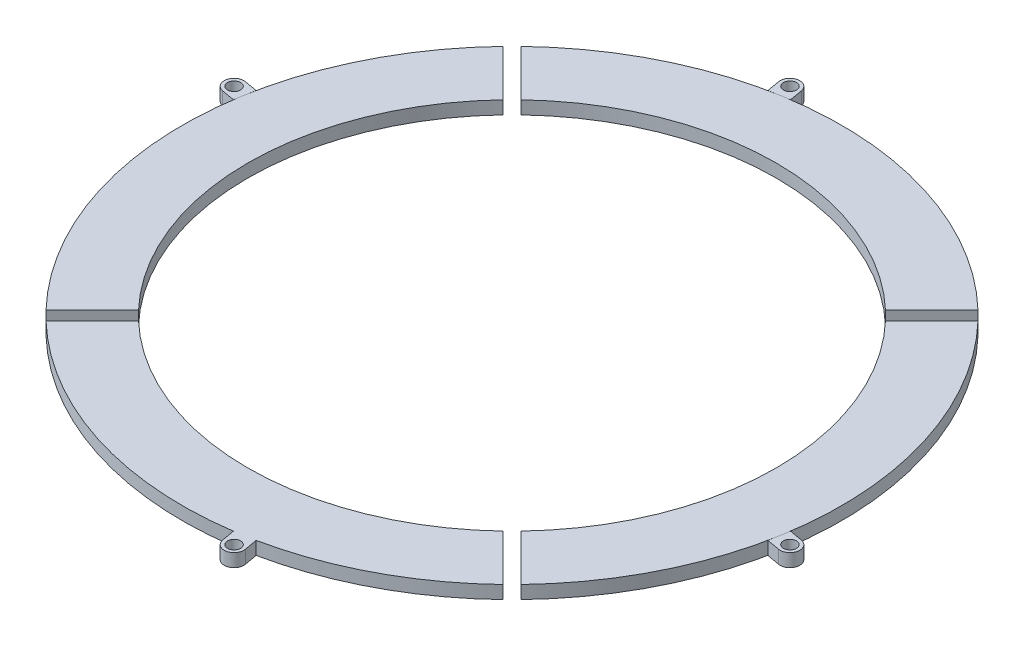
ISO-10303-21;
HEADER;
FILE_DESCRIPTION(('STEP AP214'),'2;1');
FILE_NAME('part.step','',(''),(''),'','','');
FILE_SCHEMA(('AUTOMOTIVE_DESIGN { 1 0 10303 214 1 1 1 1 }'));
ENDSEC;
DATA;
#1=APPLICATION_CONTEXT('core data for automotive mechanical design processes');
#2=APPLICATION_PROTOCOL_DEFINITION('international standard','automotive_design',2000,#1);
#3=PRODUCT_CONTEXT('',#1,'mechanical');
#4=PRODUCT('Part','Part','',(#3));
#5=PRODUCT_RELATED_PRODUCT_CATEGORY('part','',(#4));
#6=PRODUCT_DEFINITION_FORMATION('','',#4);
#7=PRODUCT_DEFINITION_CONTEXT('part definition',#1,'design');
#8=PRODUCT_DEFINITION('design','',#6,#7);
#9=PRODUCT_DEFINITION_SHAPE('','',#8);
#10=(LENGTH_UNIT() NAMED_UNIT(*) SI_UNIT(.MILLI.,.METRE.));
#11=(NAMED_UNIT(*) PLANE_ANGLE_UNIT() SI_UNIT($,.RADIAN.));
#12=(NAMED_UNIT(*) SI_UNIT($,.STERADIAN.) SOLID_ANGLE_UNIT());
#13=UNCERTAINTY_MEASURE_WITH_UNIT(LENGTH_MEASURE(1.E-05),#10,'distance_accuracy_value','');
#14=(GEOMETRIC_REPRESENTATION_CONTEXT(3) GLOBAL_UNCERTAINTY_ASSIGNED_CONTEXT((#13)) GLOBAL_UNIT_ASSIGNED_CONTEXT((#10,
#11,#12)) REPRESENTATION_CONTEXT('',''));
#15=CARTESIAN_POINT('',(0.,0.,0.));
#16=DIRECTION('',(0.,0.,1.));
#17=DIRECTION('',(1.,0.,0.));
#18=AXIS2_PLACEMENT_3D('',#15,#16,#17);
#19=CARTESIAN_POINT('',(-9.09916450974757,7.01559693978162,-51.6039262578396));
#20=DIRECTION('',(0.,-1.,0.));
#21=DIRECTION('',(0.,0.,-1.));
#22=AXIS2_PLACEMENT_3D('',#19,#20,#21);
#23=CYLINDRICAL_SURFACE('',#22,1.50000000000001);
#24=DIRECTION('',(0.,-1.,0.));
#25=VECTOR('',#24,1.);
#26=CARTESIAN_POINT('',(-10.5763761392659,7.01559693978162,-51.3434539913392));
#27=LINE('',#26,#25);
#28=CARTESIAN_POINT('',(-10.5763761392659,2.,-51.3434539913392));
#29=VERTEX_POINT('',#28);
#30=CARTESIAN_POINT('',(-10.5763761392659,0.,-51.3434539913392));
#31=VERTEX_POINT('',#30);
#32=EDGE_CURVE('E197',#29,#31,#27,.T.);
#33=ORIENTED_EDGE('',*,*,#32,.F.);
#34=CARTESIAN_POINT('',(-9.09916450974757,2.,-51.6039262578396));
#35=DIRECTION('',(0.,1.,0.));
#36=DIRECTION('',(0.,0.,1.));
#37=AXIS2_PLACEMENT_3D('',#34,#35,#36);
#38=CIRCLE('',#37,1.50000000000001);
#39=CARTESIAN_POINT('',(-7.62195288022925,2.,-51.86439852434));
#40=VERTEX_POINT('',#39);
#41=EDGE_CURVE('E187',#29,#40,#38,.F.);
#42=ORIENTED_EDGE('',*,*,#41,.T.);
#43=DIRECTION('',(0.,-1.,0.));
#44=VECTOR('',#43,1.);
#45=CARTESIAN_POINT('',(-7.62195288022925,7.01559693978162,-51.86439852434));
#46=LINE('',#45,#44);
#47=CARTESIAN_POINT('',(-7.62195288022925,0.,-51.86439852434));
#48=VERTEX_POINT('',#47);
#49=EDGE_CURVE('E152',#40,#48,#46,.T.);
#50=ORIENTED_EDGE('',*,*,#49,.T.);
#51=CARTESIAN_POINT('',(-9.09916450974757,0.,-51.6039262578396));
#52=DIRECTION('',(0.,-1.,0.));
#53=DIRECTION('',(0.,0.,-1.));
#54=AXIS2_PLACEMENT_3D('',#51,#52,#53);
#55=CIRCLE('',#54,1.50000000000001);
#56=EDGE_CURVE('E199',#31,#48,#55,.T.);
#57=ORIENTED_EDGE('',*,*,#56,.F.);
#58=EDGE_LOOP('',(#33,#42,#50,#57));
#59=FACE_BOUND('',#58,.T.);
#60=ADVANCED_FACE('F148',(#59),#23,.T.);
#61=CARTESIAN_POINT('',(-10.2252028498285,7.01559693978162,-49.3518512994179));
#62=DIRECTION('',(-0.984807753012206,0.,0.173648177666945));
#63=DIRECTION('',(0.173648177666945,0.,0.984807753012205));
#64=AXIS2_PLACEMENT_3D('',#61,#62,#63);
#65=PLANE('',#64);
#66=DIRECTION('',(0.,-1.,0.));
#67=VECTOR('',#66,1.);
#68=CARTESIAN_POINT('',(-10.2252028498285,7.01559693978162,-49.3518512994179));
#69=LINE('',#68,#67);
#70=CARTESIAN_POINT('',(-10.2252028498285,2.,-49.3518512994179));
#71=VERTEX_POINT('',#70);
#72=CARTESIAN_POINT('',(-10.2252028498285,0.,-49.3518512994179));
#73=VERTEX_POINT('',#72);
#74=EDGE_CURVE('E205',#71,#73,#69,.T.);
#75=ORIENTED_EDGE('',*,*,#74,.F.);
#76=DIRECTION('',(-0.173648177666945,0.,-0.984807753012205));
#77=VECTOR('',#76,1.);
#78=CARTESIAN_POINT('',(-10.2252028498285,2.,-49.3518512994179));
#79=LINE('',#78,#77);
#80=EDGE_CURVE('E191',#71,#29,#79,.T.);
#81=ORIENTED_EDGE('',*,*,#80,.T.);
#82=ORIENTED_EDGE('',*,*,#32,.T.);
#83=DIRECTION('',(-0.173648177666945,0.,-0.984807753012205));
#84=VECTOR('',#83,1.);
#85=CARTESIAN_POINT('',(-10.2252028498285,0.,-49.3518512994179));
#86=LINE('',#85,#84);
#87=EDGE_CURVE('E157',#73,#31,#86,.T.);
#88=ORIENTED_EDGE('',*,*,#87,.F.);
#89=EDGE_LOOP('',(#75,#81,#82,#88));
#90=FACE_BOUND('',#89,.T.);
#91=ADVANCED_FACE('F204',(#90),#65,.T.);
#92=CARTESIAN_POINT('',(-10.2252028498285,7.01559693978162,-49.3518512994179));
#93=DIRECTION('',(0.173648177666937,0.,0.984807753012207));
#94=DIRECTION('',(0.984807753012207,0.,-0.173648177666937));
#95=AXIS2_PLACEMENT_3D('',#92,#93,#94);
#96=PLANE('',#95);
#97=DIRECTION('',(0.,-1.,0.));
#98=VECTOR('',#97,1.);
#99=CARTESIAN_POINT('',(-7.2707795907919,7.01559693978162,-49.8727958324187));
#100=LINE('',#99,#98);
#101=CARTESIAN_POINT('',(-7.2707795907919,2.,-49.8727958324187));
#102=VERTEX_POINT('',#101);
#103=CARTESIAN_POINT('',(-7.2707795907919,0.,-49.8727958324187));
#104=VERTEX_POINT('',#103);
#105=EDGE_CURVE('E210',#102,#104,#100,.T.);
#106=ORIENTED_EDGE('',*,*,#105,.F.);
#107=DIRECTION('',(-0.984807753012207,0.,0.173648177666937));
#108=VECTOR('',#107,1.);
#109=CARTESIAN_POINT('',(-10.2252028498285,2.,-49.3518512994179));
#110=LINE('',#109,#108);
#111=EDGE_CURVE('E171',#102,#71,#110,.T.);
#112=ORIENTED_EDGE('',*,*,#111,.T.);
#113=ORIENTED_EDGE('',*,*,#74,.T.);
#114=DIRECTION('',(-0.984807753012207,0.,0.173648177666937));
#115=VECTOR('',#114,1.);
#116=CARTESIAN_POINT('',(-10.2252028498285,0.,-49.3518512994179));
#117=LINE('',#116,#115);
#118=EDGE_CURVE('E222',#104,#73,#117,.T.);
#119=ORIENTED_EDGE('',*,*,#118,.F.);
#120=EDGE_LOOP('',(#106,#112,#113,#119));
#121=FACE_BOUND('',#120,.T.);
#122=ADVANCED_FACE('F228',(#121),#96,.T.);
#123=CARTESIAN_POINT('',(-7.2707795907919,7.01559693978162,-49.8727958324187));
#124=DIRECTION('',(0.984807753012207,0.,-0.173648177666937));
#125=DIRECTION('',(-0.173648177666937,0.,-0.984807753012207));
#126=AXIS2_PLACEMENT_3D('',#123,#124,#125);
#127=PLANE('',#126);
#128=ORIENTED_EDGE('',*,*,#49,.F.);
#129=DIRECTION('',(0.173648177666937,0.,0.984807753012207));
#130=VECTOR('',#129,1.);
#131=CARTESIAN_POINT('',(-7.2707795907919,2.,-49.8727958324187));
#132=LINE('',#131,#130);
#133=EDGE_CURVE('E165',#40,#102,#132,.T.);
#134=ORIENTED_EDGE('',*,*,#133,.T.);
#135=ORIENTED_EDGE('',*,*,#105,.T.);
#136=DIRECTION('',(0.173648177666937,0.,0.984807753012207));
#137=VECTOR('',#136,1.);
#138=CARTESIAN_POINT('',(-7.2707795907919,0.,-49.8727958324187));
#139=LINE('',#138,#137);
#140=EDGE_CURVE('E219',#48,#104,#139,.T.);
#141=ORIENTED_EDGE('',*,*,#140,.F.);
#142=EDGE_LOOP('',(#128,#134,#135,#141));
#143=FACE_BOUND('',#142,.T.);
#144=ADVANCED_FACE('F230',(#143),#127,.T.);
#145=CARTESIAN_POINT('',(-9.09916450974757,7.01559693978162,-51.6039262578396));
#146=DIRECTION('',(0.,-1.,0.));
#147=DIRECTION('',(0.,0.,-1.));
#148=AXIS2_PLACEMENT_3D('',#145,#146,#147);
#149=CYLINDRICAL_SURFACE('',#148,0.999999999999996);
#150=CARTESIAN_POINT('',(-9.09916450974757,0.,-51.6039262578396));
#151=DIRECTION('',(0.,-1.,0.));
#152=DIRECTION('',(0.,0.,-1.));
#153=AXIS2_PLACEMENT_3D('',#150,#151,#152);
#154=CIRCLE('',#153,0.999999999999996);
#155=CARTESIAN_POINT('',(-9.09916450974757,0.,-52.6039262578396));
#156=VERTEX_POINT('',#155);
#157=EDGE_CURVE('E211',#156,#156,#154,.T.);
#158=ORIENTED_EDGE('',*,*,#157,.T.);
#159=EDGE_LOOP('',(#158));
#160=FACE_BOUND('',#159,.T.);
#161=CARTESIAN_POINT('',(-9.09916450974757,2.,-51.6039262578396));
#162=DIRECTION('',(0.,1.,0.));
#163=DIRECTION('',(0.,0.,1.));
#164=AXIS2_PLACEMENT_3D('',#161,#162,#163);
#165=CIRCLE('',#164,0.999999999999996);
#166=CARTESIAN_POINT('',(-9.09916450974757,2.,-50.6039262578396));
#167=VERTEX_POINT('',#166);
#168=EDGE_CURVE('E13',#167,#167,#165,.F.);
#169=ORIENTED_EDGE('',*,*,#168,.F.);
#170=EDGE_LOOP('',(#169));
#171=FACE_BOUND('',#170,.T.);
#172=ADVANCED_FACE('F236',(#160,#171),#149,.F.);
#173=CARTESIAN_POINT('',(-9.09916450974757,0.,-51.6039262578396));
#174=DIRECTION('',(0.,-1.,0.));
#175=DIRECTION('',(0.,0.,-1.));
#176=AXIS2_PLACEMENT_3D('',#173,#174,#175);
#177=PLANE('',#176);
#178=ORIENTED_EDGE('',*,*,#157,.F.);
#179=EDGE_LOOP('',(#178));
#180=FACE_BOUND('',#179,.T.);
#181=ORIENTED_EDGE('',*,*,#56,.T.);
#182=ORIENTED_EDGE('',*,*,#140,.T.);
#183=ORIENTED_EDGE('',*,*,#118,.T.);
#184=ORIENTED_EDGE('',*,*,#87,.T.);
#185=EDGE_LOOP('',(#181,#182,#183,#184));
#186=FACE_BOUND('',#185,.T.);
#187=ADVANCED_FACE('F226',(#180,#186),#177,.T.);
#188=CARTESIAN_POINT('',(0.,2.,0.));
#189=DIRECTION('',(0.,1.,0.));
#190=DIRECTION('',(0.,0.,1.));
#191=AXIS2_PLACEMENT_3D('',#188,#189,#190);
#192=PLANE('',#191);
#193=ORIENTED_EDGE('',*,*,#41,.F.);
#194=ORIENTED_EDGE('',*,*,#80,.F.);
#195=ORIENTED_EDGE('',*,*,#111,.F.);
#196=ORIENTED_EDGE('',*,*,#133,.F.);
#197=EDGE_LOOP('',(#193,#194,#195,#196));
#198=FACE_BOUND('',#197,.T.);
#199=ORIENTED_EDGE('',*,*,#168,.T.);
#200=EDGE_LOOP('',(#199));
#201=FACE_BOUND('',#200,.T.);
#202=ADVANCED_FACE('F150',(#198,#201),#192,.T.);
#203=CLOSED_SHELL('',(#60,#91,#122,#144,#172,#187,#202));
#204=MANIFOLD_SOLID_BREP('B2',#203);
#205=CARTESIAN_POINT('',(-51.6039262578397,7.01559693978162,-9.0991645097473));
#206=DIRECTION('',(0.,-1.,0.));
#207=DIRECTION('',(0.,0.,-1.));
#208=AXIS2_PLACEMENT_3D('',#205,#206,#207);
#209=CYLINDRICAL_SURFACE('',#208,1.5);
#210=DIRECTION('',(0.,-1.,0.));
#211=VECTOR('',#210,1.);
#212=CARTESIAN_POINT('',(-51.8643985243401,7.01559693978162,-7.62195288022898));
#213=LINE('',#212,#211);
#214=CARTESIAN_POINT('',(-51.8643985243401,2.,-7.62195288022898));
#215=VERTEX_POINT('',#214);
#216=CARTESIAN_POINT('',(-51.8643985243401,0.,-7.62195288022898));
#217=VERTEX_POINT('',#216);
#218=EDGE_CURVE('E352',#215,#217,#213,.T.);
#219=ORIENTED_EDGE('',*,*,#218,.F.);
#220=CARTESIAN_POINT('',(-51.6039262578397,2.,-9.0991645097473));
#221=DIRECTION('',(0.,1.,0.));
#222=DIRECTION('',(0.,0.,1.));
#223=AXIS2_PLACEMENT_3D('',#220,#221,#222);
#224=CIRCLE('',#223,1.5);
#225=CARTESIAN_POINT('',(-51.3434539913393,2.,-10.5763761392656));
#226=VERTEX_POINT('',#225);
#227=EDGE_CURVE('E342',#215,#226,#224,.F.);
#228=ORIENTED_EDGE('',*,*,#227,.T.);
#229=DIRECTION('',(0.,-1.,0.));
#230=VECTOR('',#229,1.);
#231=CARTESIAN_POINT('',(-51.3434539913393,7.01559693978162,-10.5763761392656));
#232=LINE('',#231,#230);
#233=CARTESIAN_POINT('',(-51.3434539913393,0.,-10.5763761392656));
#234=VERTEX_POINT('',#233);
#235=EDGE_CURVE('E307',#226,#234,#232,.T.);
#236=ORIENTED_EDGE('',*,*,#235,.T.);
#237=CARTESIAN_POINT('',(-51.6039262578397,0.,-9.0991645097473));
#238=DIRECTION('',(0.,-1.,0.));
#239=DIRECTION('',(0.,0.,1.));
#240=AXIS2_PLACEMENT_3D('',#237,#238,#239);
#241=CIRCLE('',#240,1.5);
#242=EDGE_CURVE('E354',#217,#234,#241,.T.);
#243=ORIENTED_EDGE('',*,*,#242,.F.);
#244=EDGE_LOOP('',(#219,#228,#236,#243));
#245=FACE_BOUND('',#244,.T.);
#246=ADVANCED_FACE('F303',(#245),#209,.T.);
#247=CARTESIAN_POINT('',(-49.8727958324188,7.01559693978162,-7.27077959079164));
#248=DIRECTION('',(-0.173648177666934,0.,0.984807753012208));
#249=DIRECTION('',(0.984807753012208,0.,0.173648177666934));
#250=AXIS2_PLACEMENT_3D('',#247,#248,#249);
#251=PLANE('',#250);
#252=DIRECTION('',(0.,-1.,0.));
#253=VECTOR('',#252,1.);
#254=CARTESIAN_POINT('',(-49.8727958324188,7.01559693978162,-7.27077959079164));
#255=LINE('',#254,#253);
#256=CARTESIAN_POINT('',(-49.8727958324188,2.,-7.27077959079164));
#257=VERTEX_POINT('',#256);
#258=CARTESIAN_POINT('',(-49.8727958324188,0.,-7.27077959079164));
#259=VERTEX_POINT('',#258);
#260=EDGE_CURVE('E360',#257,#259,#255,.T.);
#261=ORIENTED_EDGE('',*,*,#260,.F.);
#262=DIRECTION('',(-0.984807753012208,0.,-0.173648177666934));
#263=VECTOR('',#262,1.);
#264=CARTESIAN_POINT('',(-49.8727958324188,2.,-7.27077959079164));
#265=LINE('',#264,#263);
#266=EDGE_CURVE('E346',#257,#215,#265,.T.);
#267=ORIENTED_EDGE('',*,*,#266,.T.);
#268=ORIENTED_EDGE('',*,*,#218,.T.);
#269=DIRECTION('',(-0.984807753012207,0.,-0.173648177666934));
#270=VECTOR('',#269,1.);
#271=CARTESIAN_POINT('',(-49.8727958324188,0.,-7.27077959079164));
#272=LINE('',#271,#270);
#273=EDGE_CURVE('E312',#259,#217,#272,.T.);
#274=ORIENTED_EDGE('',*,*,#273,.F.);
#275=EDGE_LOOP('',(#261,#267,#268,#274));
#276=FACE_BOUND('',#275,.T.);
#277=ADVANCED_FACE('F359',(#276),#251,.T.);
#278=CARTESIAN_POINT('',(-49.351851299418,7.01559693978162,-10.2252028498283));
#279=DIRECTION('',(0.984807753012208,0.,0.173648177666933));
#280=DIRECTION('',(0.173648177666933,0.,-0.984807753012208));
#281=AXIS2_PLACEMENT_3D('',#278,#279,#280);
#282=PLANE('',#281);
#283=DIRECTION('',(0.,-1.,0.));
#284=VECTOR('',#283,1.);
#285=CARTESIAN_POINT('',(-49.351851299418,7.01559693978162,-10.2252028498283));
#286=LINE('',#285,#284);
#287=CARTESIAN_POINT('',(-49.351851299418,2.,-10.2252028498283));
#288=VERTEX_POINT('',#287);
#289=CARTESIAN_POINT('',(-49.351851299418,0.,-10.2252028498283));
#290=VERTEX_POINT('',#289);
#291=EDGE_CURVE('E365',#288,#290,#286,.T.);
#292=ORIENTED_EDGE('',*,*,#291,.F.);
#293=DIRECTION('',(-0.173648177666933,0.,0.984807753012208));
#294=VECTOR('',#293,1.);
#295=CARTESIAN_POINT('',(-49.351851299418,2.,-10.2252028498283));
#296=LINE('',#295,#294);
#297=EDGE_CURVE('E326',#288,#257,#296,.T.);
#298=ORIENTED_EDGE('',*,*,#297,.T.);
#299=ORIENTED_EDGE('',*,*,#260,.T.);
#300=DIRECTION('',(-0.173648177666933,0.,0.984807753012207));
#301=VECTOR('',#300,1.);
#302=CARTESIAN_POINT('',(-49.351851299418,0.,-10.2252028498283));
#303=LINE('',#302,#301);
#304=EDGE_CURVE('E377',#290,#259,#303,.T.);
#305=ORIENTED_EDGE('',*,*,#304,.F.);
#306=EDGE_LOOP('',(#292,#298,#299,#305));
#307=FACE_BOUND('',#306,.T.);
#308=ADVANCED_FACE('F383',(#307),#282,.T.);
#309=CARTESIAN_POINT('',(-49.351851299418,7.01559693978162,-10.2252028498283));
#310=DIRECTION('',(0.173648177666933,0.,-0.984807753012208));
#311=DIRECTION('',(-0.984807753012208,0.,-0.173648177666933));
#312=AXIS2_PLACEMENT_3D('',#309,#310,#311);
#313=PLANE('',#312);
#314=ORIENTED_EDGE('',*,*,#235,.F.);
#315=DIRECTION('',(0.984807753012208,0.,0.173648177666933));
#316=VECTOR('',#315,1.);
#317=CARTESIAN_POINT('',(-49.351851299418,2.,-10.2252028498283));
#318=LINE('',#317,#316);
#319=EDGE_CURVE('E320',#226,#288,#318,.T.);
#320=ORIENTED_EDGE('',*,*,#319,.T.);
#321=ORIENTED_EDGE('',*,*,#291,.T.);
#322=DIRECTION('',(0.984807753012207,0.,0.173648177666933));
#323=VECTOR('',#322,1.);
#324=CARTESIAN_POINT('',(-49.351851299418,0.,-10.2252028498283));
#325=LINE('',#324,#323);
#326=EDGE_CURVE('E374',#234,#290,#325,.T.);
#327=ORIENTED_EDGE('',*,*,#326,.F.);
#328=EDGE_LOOP('',(#314,#320,#321,#327));
#329=FACE_BOUND('',#328,.T.);
#330=ADVANCED_FACE('F385',(#329),#313,.T.);
#331=CARTESIAN_POINT('',(-51.6039262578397,7.01559693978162,-9.0991645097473));
#332=DIRECTION('',(0.,-1.,0.));
#333=DIRECTION('',(0.,0.,-1.));
#334=AXIS2_PLACEMENT_3D('',#331,#332,#333);
#335=CYLINDRICAL_SURFACE('',#334,0.999999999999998);
#336=CARTESIAN_POINT('',(-51.6039262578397,0.,-9.0991645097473));
#337=DIRECTION('',(0.,-1.,0.));
#338=DIRECTION('',(0.,0.,1.));
#339=AXIS2_PLACEMENT_3D('',#336,#337,#338);
#340=CIRCLE('',#339,0.999999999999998);
#341=CARTESIAN_POINT('',(-51.6039262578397,0.,-8.0991645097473));
#342=VERTEX_POINT('',#341);
#343=EDGE_CURVE('E366',#342,#342,#340,.T.);
#344=ORIENTED_EDGE('',*,*,#343,.T.);
#345=EDGE_LOOP('',(#344));
#346=FACE_BOUND('',#345,.T.);
#347=CARTESIAN_POINT('',(-51.6039262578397,2.,-9.0991645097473));
#348=DIRECTION('',(0.,1.,0.));
#349=DIRECTION('',(0.,0.,1.));
#350=AXIS2_PLACEMENT_3D('',#347,#348,#349);
#351=CIRCLE('',#350,0.999999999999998);
#352=CARTESIAN_POINT('',(-51.6039262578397,2.,-8.0991645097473));
#353=VERTEX_POINT('',#352);
#354=EDGE_CURVE('E146',#353,#353,#351,.F.);
#355=ORIENTED_EDGE('',*,*,#354,.F.);
#356=EDGE_LOOP('',(#355));
#357=FACE_BOUND('',#356,.T.);
#358=ADVANCED_FACE('F391',(#346,#357),#335,.F.);
#359=CARTESIAN_POINT('',(-51.6039262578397,0.,-9.0991645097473));
#360=DIRECTION('',(0.,1.,0.));
#361=DIRECTION('',(0.,0.,1.));
#362=AXIS2_PLACEMENT_3D('',#359,#360,#361);
#363=PLANE('',#362);
#364=ORIENTED_EDGE('',*,*,#343,.F.);
#365=EDGE_LOOP('',(#364));
#366=FACE_BOUND('',#365,.T.);
#367=ORIENTED_EDGE('',*,*,#242,.T.);
#368=ORIENTED_EDGE('',*,*,#326,.T.);
#369=ORIENTED_EDGE('',*,*,#304,.T.);
#370=ORIENTED_EDGE('',*,*,#273,.T.);
#371=EDGE_LOOP('',(#367,#368,#369,#370));
#372=FACE_BOUND('',#371,.T.);
#373=ADVANCED_FACE('F381',(#366,#372),#363,.F.);
#374=CARTESIAN_POINT('',(0.,2.,0.));
#375=DIRECTION('',(0.,1.,0.));
#376=DIRECTION('',(0.,0.,1.));
#377=AXIS2_PLACEMENT_3D('',#374,#375,#376);
#378=PLANE('',#377);
#379=ORIENTED_EDGE('',*,*,#227,.F.);
#380=ORIENTED_EDGE('',*,*,#266,.F.);
#381=ORIENTED_EDGE('',*,*,#297,.F.);
#382=ORIENTED_EDGE('',*,*,#319,.F.);
#383=EDGE_LOOP('',(#379,#380,#381,#382));
#384=FACE_BOUND('',#383,.T.);
#385=ORIENTED_EDGE('',*,*,#354,.T.);
#386=EDGE_LOOP('',(#385));
#387=FACE_BOUND('',#386,.T.);
#388=ADVANCED_FACE('F305',(#384,#387),#378,.T.);
#389=CLOSED_SHELL('',(#246,#277,#308,#330,#358,#373,#388));
#390=MANIFOLD_SOLID_BREP('B7',#389);
#391=CARTESIAN_POINT('',(51.6039262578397,7.01559693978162,9.0991645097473));
#392=DIRECTION('',(0.,-1.,0.));
#393=DIRECTION('',(0.,0.,-1.));
#394=AXIS2_PLACEMENT_3D('',#391,#392,#393);
#395=CYLINDRICAL_SURFACE('',#394,1.5);
#396=DIRECTION('',(0.,-1.,0.));
#397=VECTOR('',#396,1.);
#398=CARTESIAN_POINT('',(51.8643985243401,7.01559693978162,7.62195288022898));
#399=LINE('',#398,#397);
#400=CARTESIAN_POINT('',(51.8643985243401,2.,7.62195288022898));
#401=VERTEX_POINT('',#400);
#402=CARTESIAN_POINT('',(51.8643985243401,0.,7.62195288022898));
#403=VERTEX_POINT('',#402);
#404=EDGE_CURVE('E507',#401,#403,#399,.T.);
#405=ORIENTED_EDGE('',*,*,#404,.F.);
#406=CARTESIAN_POINT('',(51.6039262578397,2.,9.0991645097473));
#407=DIRECTION('',(0.,1.,0.));
#408=DIRECTION('',(0.,0.,1.));
#409=AXIS2_PLACEMENT_3D('',#406,#407,#408);
#410=CIRCLE('',#409,1.5);
#411=CARTESIAN_POINT('',(51.3434539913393,2.,10.5763761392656));
#412=VERTEX_POINT('',#411);
#413=EDGE_CURVE('E497',#401,#412,#410,.F.);
#414=ORIENTED_EDGE('',*,*,#413,.T.);
#415=DIRECTION('',(0.,-1.,0.));
#416=VECTOR('',#415,1.);
#417=CARTESIAN_POINT('',(51.3434539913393,7.01559693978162,10.5763761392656));
#418=LINE('',#417,#416);
#419=CARTESIAN_POINT('',(51.3434539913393,0.,10.5763761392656));
#420=VERTEX_POINT('',#419);
#421=EDGE_CURVE('E462',#412,#420,#418,.T.);
#422=ORIENTED_EDGE('',*,*,#421,.T.);
#423=CARTESIAN_POINT('',(51.6039262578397,0.,9.0991645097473));
#424=DIRECTION('',(0.,-1.,0.));
#425=DIRECTION('',(0.,0.,1.));
#426=AXIS2_PLACEMENT_3D('',#423,#424,#425);
#427=CIRCLE('',#426,1.5);
#428=EDGE_CURVE('E509',#403,#420,#427,.T.);
#429=ORIENTED_EDGE('',*,*,#428,.F.);
#430=EDGE_LOOP('',(#405,#414,#422,#429));
#431=FACE_BOUND('',#430,.T.);
#432=ADVANCED_FACE('F458',(#431),#395,.T.);
#433=CARTESIAN_POINT('',(49.8727958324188,7.01559693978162,7.27077959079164));
#434=DIRECTION('',(0.173648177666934,0.,-0.984807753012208));
#435=DIRECTION('',(-0.984807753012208,0.,-0.173648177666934));
#436=AXIS2_PLACEMENT_3D('',#433,#434,#435);
#437=PLANE('',#436);
#438=DIRECTION('',(0.,-1.,0.));
#439=VECTOR('',#438,1.);
#440=CARTESIAN_POINT('',(49.8727958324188,7.01559693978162,7.27077959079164));
#441=LINE('',#440,#439);
#442=CARTESIAN_POINT('',(49.8727958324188,2.,7.27077959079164));
#443=VERTEX_POINT('',#442);
#444=CARTESIAN_POINT('',(49.8727958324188,0.,7.27077959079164));
#445=VERTEX_POINT('',#444);
#446=EDGE_CURVE('E515',#443,#445,#441,.T.);
#447=ORIENTED_EDGE('',*,*,#446,.F.);
#448=DIRECTION('',(0.984807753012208,0.,0.173648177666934));
#449=VECTOR('',#448,1.);
#450=CARTESIAN_POINT('',(49.8727958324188,2.,7.27077959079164));
#451=LINE('',#450,#449);
#452=EDGE_CURVE('E501',#443,#401,#451,.T.);
#453=ORIENTED_EDGE('',*,*,#452,.T.);
#454=ORIENTED_EDGE('',*,*,#404,.T.);
#455=DIRECTION('',(0.984807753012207,0.,0.173648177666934));
#456=VECTOR('',#455,1.);
#457=CARTESIAN_POINT('',(49.8727958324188,0.,7.27077959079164));
#458=LINE('',#457,#456);
#459=EDGE_CURVE('E467',#445,#403,#458,.T.);
#460=ORIENTED_EDGE('',*,*,#459,.F.);
#461=EDGE_LOOP('',(#447,#453,#454,#460));
#462=FACE_BOUND('',#461,.T.);
#463=ADVANCED_FACE('F514',(#462),#437,.T.);
#464=CARTESIAN_POINT('',(49.351851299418,7.01559693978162,10.2252028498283));
#465=DIRECTION('',(-0.984807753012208,0.,-0.173648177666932));
#466=DIRECTION('',(-0.173648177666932,0.,0.984807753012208));
#467=AXIS2_PLACEMENT_3D('',#464,#465,#466);
#468=PLANE('',#467);
#469=DIRECTION('',(0.,-1.,0.));
#470=VECTOR('',#469,1.);
#471=CARTESIAN_POINT('',(49.351851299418,7.01559693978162,10.2252028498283));
#472=LINE('',#471,#470);
#473=CARTESIAN_POINT('',(49.351851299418,2.,10.2252028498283));
#474=VERTEX_POINT('',#473);
#475=CARTESIAN_POINT('',(49.351851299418,0.,10.2252028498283));
#476=VERTEX_POINT('',#475);
#477=EDGE_CURVE('E520',#474,#476,#472,.T.);
#478=ORIENTED_EDGE('',*,*,#477,.F.);
#479=DIRECTION('',(0.173648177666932,0.,-0.984807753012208));
#480=VECTOR('',#479,1.);
#481=CARTESIAN_POINT('',(49.351851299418,2.,10.2252028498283));
#482=LINE('',#481,#480);
#483=EDGE_CURVE('E481',#474,#443,#482,.T.);
#484=ORIENTED_EDGE('',*,*,#483,.T.);
#485=ORIENTED_EDGE('',*,*,#446,.T.);
#486=DIRECTION('',(0.173648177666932,0.,-0.984807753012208));
#487=VECTOR('',#486,1.);
#488=CARTESIAN_POINT('',(49.351851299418,0.,10.2252028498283));
#489=LINE('',#488,#487);
#490=EDGE_CURVE('E532',#476,#445,#489,.T.);
#491=ORIENTED_EDGE('',*,*,#490,.F.);
#492=EDGE_LOOP('',(#478,#484,#485,#491));
#493=FACE_BOUND('',#492,.T.);
#494=ADVANCED_FACE('F538',(#493),#468,.T.);
#495=CARTESIAN_POINT('',(49.351851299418,7.01559693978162,10.2252028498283));
#496=DIRECTION('',(-0.173648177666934,0.,0.984807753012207));
#497=DIRECTION('',(0.984807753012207,0.,0.173648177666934));
#498=AXIS2_PLACEMENT_3D('',#495,#496,#497);
#499=PLANE('',#498);
#500=ORIENTED_EDGE('',*,*,#421,.F.);
#501=DIRECTION('',(-0.984807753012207,0.,-0.173648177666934));
#502=VECTOR('',#501,1.);
#503=CARTESIAN_POINT('',(49.351851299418,2.,10.2252028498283));
#504=LINE('',#503,#502);
#505=EDGE_CURVE('E475',#412,#474,#504,.T.);
#506=ORIENTED_EDGE('',*,*,#505,.T.);
#507=ORIENTED_EDGE('',*,*,#477,.T.);
#508=DIRECTION('',(-0.984807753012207,0.,-0.173648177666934));
#509=VECTOR('',#508,1.);
#510=CARTESIAN_POINT('',(49.351851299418,0.,10.2252028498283));
#511=LINE('',#510,#509);
#512=EDGE_CURVE('E529',#420,#476,#511,.T.);
#513=ORIENTED_EDGE('',*,*,#512,.F.);
#514=EDGE_LOOP('',(#500,#506,#507,#513));
#515=FACE_BOUND('',#514,.T.);
#516=ADVANCED_FACE('F540',(#515),#499,.T.);
#517=CARTESIAN_POINT('',(51.6039262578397,7.01559693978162,9.0991645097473));
#518=DIRECTION('',(0.,-1.,0.));
#519=DIRECTION('',(0.,0.,-1.));
#520=AXIS2_PLACEMENT_3D('',#517,#518,#519);
#521=CYLINDRICAL_SURFACE('',#520,0.999999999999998);
#522=CARTESIAN_POINT('',(51.6039262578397,0.,9.0991645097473));
#523=DIRECTION('',(0.,-1.,0.));
#524=DIRECTION('',(0.,0.,1.));
#525=AXIS2_PLACEMENT_3D('',#522,#523,#524);
#526=CIRCLE('',#525,0.999999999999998);
#527=CARTESIAN_POINT('',(51.6039262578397,0.,10.0991645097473));
#528=VERTEX_POINT('',#527);
#529=EDGE_CURVE('E521',#528,#528,#526,.T.);
#530=ORIENTED_EDGE('',*,*,#529,.T.);
#531=EDGE_LOOP('',(#530));
#532=FACE_BOUND('',#531,.T.);
#533=CARTESIAN_POINT('',(51.6039262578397,2.,9.0991645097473));
#534=DIRECTION('',(0.,1.,0.));
#535=DIRECTION('',(0.,0.,1.));
#536=AXIS2_PLACEMENT_3D('',#533,#534,#535);
#537=CIRCLE('',#536,0.999999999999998);
#538=CARTESIAN_POINT('',(51.6039262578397,2.,10.0991645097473));
#539=VERTEX_POINT('',#538);
#540=EDGE_CURVE('E301',#539,#539,#537,.F.);
#541=ORIENTED_EDGE('',*,*,#540,.F.);
#542=EDGE_LOOP('',(#541));
#543=FACE_BOUND('',#542,.T.);
#544=ADVANCED_FACE('F546',(#532,#543),#521,.F.);
#545=CARTESIAN_POINT('',(51.6039262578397,0.,9.0991645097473));
#546=DIRECTION('',(0.,1.,0.));
#547=DIRECTION('',(0.,0.,1.));
#548=AXIS2_PLACEMENT_3D('',#545,#546,#547);
#549=PLANE('',#548);
#550=ORIENTED_EDGE('',*,*,#529,.F.);
#551=EDGE_LOOP('',(#550));
#552=FACE_BOUND('',#551,.T.);
#553=ORIENTED_EDGE('',*,*,#428,.T.);
#554=ORIENTED_EDGE('',*,*,#512,.T.);
#555=ORIENTED_EDGE('',*,*,#490,.T.);
#556=ORIENTED_EDGE('',*,*,#459,.T.);
#557=EDGE_LOOP('',(#553,#554,#555,#556));
#558=FACE_BOUND('',#557,.T.);
#559=ADVANCED_FACE('F536',(#552,#558),#549,.F.);
#560=CARTESIAN_POINT('',(0.,2.,0.));
#561=DIRECTION('',(0.,1.,0.));
#562=DIRECTION('',(0.,0.,1.));
#563=AXIS2_PLACEMENT_3D('',#560,#561,#562);
#564=PLANE('',#563);
#565=ORIENTED_EDGE('',*,*,#413,.F.);
#566=ORIENTED_EDGE('',*,*,#452,.F.);
#567=ORIENTED_EDGE('',*,*,#483,.F.);
#568=ORIENTED_EDGE('',*,*,#505,.F.);
#569=EDGE_LOOP('',(#565,#566,#567,#568));
#570=FACE_BOUND('',#569,.T.);
#571=ORIENTED_EDGE('',*,*,#540,.T.);
#572=EDGE_LOOP('',(#571));
#573=FACE_BOUND('',#572,.T.);
#574=ADVANCED_FACE('F460',(#570,#573),#564,.T.);
#575=CLOSED_SHELL('',(#432,#463,#494,#516,#544,#559,#574));
#576=MANIFOLD_SOLID_BREP('B140',#575);
#577=CARTESIAN_POINT('',(0.,2.,0.));
#578=DIRECTION('',(0.,-1.,0.));
#579=DIRECTION('',(0.,0.,-1.));
#580=AXIS2_PLACEMENT_3D('',#577,#578,#579);
#581=CYLINDRICAL_SURFACE('',#580,50.4);
#582=CARTESIAN_POINT('',(0.,2.,0.));
#583=DIRECTION('',(0.,1.,0.));
#584=DIRECTION('',(0.,0.,1.));
#585=AXIS2_PLACEMENT_3D('',#582,#583,#584);
#586=CIRCLE('',#585,50.4);
#587=CARTESIAN_POINT('',(10.2252028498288,2.,49.3518512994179));
#588=VERTEX_POINT('',#587);
#589=CARTESIAN_POINT('',(34.9240593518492,2.,36.3382729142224));
#590=VERTEX_POINT('',#589);
#591=EDGE_CURVE('E728',#588,#590,#586,.T.);
#592=ORIENTED_EDGE('',*,*,#591,.F.);
#593=DIRECTION('',(0.,-1.,0.));
#594=VECTOR('',#593,1.);
#595=CARTESIAN_POINT('',(10.2252028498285,7.01559693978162,49.3518512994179));
#596=LINE('',#595,#594);
#597=CARTESIAN_POINT('',(10.2252028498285,0.,49.3518512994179));
#598=VERTEX_POINT('',#597);
#599=EDGE_CURVE('E629',#588,#598,#596,.T.);
#600=ORIENTED_EDGE('',*,*,#599,.T.);
#601=CARTESIAN_POINT('',(0.,0.,0.));
#602=DIRECTION('',(0.,1.,0.));
#603=DIRECTION('',(0.,0.,1.));
#604=AXIS2_PLACEMENT_3D('',#601,#602,#603);
#605=CIRCLE('',#604,50.4);
#606=CARTESIAN_POINT('',(34.9240593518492,0.,36.3382729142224));
#607=VERTEX_POINT('',#606);
#608=EDGE_CURVE('E742',#598,#607,#605,.T.);
#609=ORIENTED_EDGE('',*,*,#608,.T.);
#610=DIRECTION('',(0.,-1.,0.));
#611=VECTOR('',#610,1.);
#612=CARTESIAN_POINT('',(34.9240593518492,2.,36.3382729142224));
#613=LINE('',#612,#611);
#614=EDGE_CURVE('E622',#590,#607,#613,.T.);
#615=ORIENTED_EDGE('',*,*,#614,.F.);
#616=EDGE_LOOP('',(#592,#600,#609,#615));
#617=FACE_BOUND('',#616,.T.);
#618=ADVANCED_FACE('F613',(#617),#581,.T.);
#619=CARTESIAN_POINT('',(0.707106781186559,2.,0.707106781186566));
#620=DIRECTION('',(-0.707106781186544,0.,-0.707106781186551));
#621=DIRECTION('',(-0.707106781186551,0.,0.707106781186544));
#622=AXIS2_PLACEMENT_3D('',#619,#620,#621);
#623=PLANE('',#622);
#624=DIRECTION('',(0.707106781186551,0.,-0.707106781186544));
#625=VECTOR('',#624,1.);
#626=CARTESIAN_POINT('',(0.707106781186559,0.,0.707106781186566));
#627=LINE('',#626,#625);
#628=CARTESIAN_POINT('',(-34.9240593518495,0.,36.3382729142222));
#629=VERTEX_POINT('',#628);
#630=CARTESIAN_POINT('',(-27.851254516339,0.,29.2654680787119));
#631=VERTEX_POINT('',#630);
#632=EDGE_CURVE('E739',#629,#631,#627,.T.);
#633=ORIENTED_EDGE('',*,*,#632,.F.);
#634=DIRECTION('',(0.,-1.,0.));
#635=VECTOR('',#634,1.);
#636=CARTESIAN_POINT('',(-34.9240593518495,2.,36.3382729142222));
#637=LINE('',#636,#635);
#638=CARTESIAN_POINT('',(-34.9240593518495,2.,36.3382729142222));
#639=VERTEX_POINT('',#638);
#640=EDGE_CURVE('E456',#639,#629,#637,.T.);
#641=ORIENTED_EDGE('',*,*,#640,.F.);
#642=DIRECTION('',(0.707106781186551,0.,-0.707106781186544));
#643=VECTOR('',#642,1.);
#644=CARTESIAN_POINT('',(0.707106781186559,2.,0.707106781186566));
#645=LINE('',#644,#643);
#646=CARTESIAN_POINT('',(-27.851254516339,2.,29.2654680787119));
#647=VERTEX_POINT('',#646);
#648=EDGE_CURVE('E725',#639,#647,#645,.T.);
#649=ORIENTED_EDGE('',*,*,#648,.T.);
#650=DIRECTION('',(0.,-1.,0.));
#651=VECTOR('',#650,1.);
#652=CARTESIAN_POINT('',(-27.851254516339,2.,29.2654680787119));
#653=LINE('',#652,#651);
#654=EDGE_CURVE('E638',#647,#631,#653,.T.);
#655=ORIENTED_EDGE('',*,*,#654,.T.);
#656=EDGE_LOOP('',(#633,#641,#649,#655));
#657=FACE_BOUND('',#656,.T.);
#658=ADVANCED_FACE('F615',(#657),#623,.T.);
#659=CARTESIAN_POINT('',(7.2707795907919,0.,49.8727958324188));
#660=VERTEX_POINT('',#659);
#661=EDGE_CURVE('E743',#629,#660,#605,.T.);
#662=ORIENTED_EDGE('',*,*,#661,.T.);
#663=DIRECTION('',(0.,-1.,0.));
#664=VECTOR('',#663,1.);
#665=CARTESIAN_POINT('',(7.2707795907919,7.01559693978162,49.8727958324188));
#666=LINE('',#665,#664);
#667=CARTESIAN_POINT('',(7.2707795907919,2.,49.8727958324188));
#668=VERTEX_POINT('',#667);
#669=EDGE_CURVE('E694',#668,#660,#666,.T.);
#670=ORIENTED_EDGE('',*,*,#669,.F.);
#671=EDGE_CURVE('E690',#639,#668,#586,.T.);
#672=ORIENTED_EDGE('',*,*,#671,.F.);
#673=ORIENTED_EDGE('',*,*,#640,.T.);
#674=EDGE_LOOP('',(#662,#670,#672,#673));
#675=FACE_BOUND('',#674,.T.);
#676=ADVANCED_FACE('F804',(#675),#581,.T.);
#677=CARTESIAN_POINT('',(-0.707106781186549,2.,0.707106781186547));
#678=DIRECTION('',(0.707106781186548,0.,-0.707106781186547));
#679=DIRECTION('',(-0.707106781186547,0.,-0.707106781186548));
#680=AXIS2_PLACEMENT_3D('',#677,#678,#679);
#681=PLANE('',#680);
#682=DIRECTION('',(0.707106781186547,0.,0.707106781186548));
#683=VECTOR('',#682,1.);
#684=CARTESIAN_POINT('',(-0.707106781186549,0.,0.707106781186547));
#685=LINE('',#684,#683);
#686=CARTESIAN_POINT('',(27.8512545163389,0.,29.265468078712));
#687=VERTEX_POINT('',#686);
#688=EDGE_CURVE('E747',#687,#607,#685,.T.);
#689=ORIENTED_EDGE('',*,*,#688,.F.);
#690=DIRECTION('',(0.,-1.,0.));
#691=VECTOR('',#690,1.);
#692=CARTESIAN_POINT('',(27.8512545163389,2.,29.265468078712));
#693=LINE('',#692,#691);
#694=CARTESIAN_POINT('',(27.8512545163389,2.,29.265468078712));
#695=VERTEX_POINT('',#694);
#696=EDGE_CURVE('E756',#695,#687,#693,.T.);
#697=ORIENTED_EDGE('',*,*,#696,.F.);
#698=DIRECTION('',(0.707106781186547,0.,0.707106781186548));
#699=VECTOR('',#698,1.);
#700=CARTESIAN_POINT('',(-0.707106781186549,2.,0.707106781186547));
#701=LINE('',#700,#699);
#702=EDGE_CURVE('E732',#695,#590,#701,.T.);
#703=ORIENTED_EDGE('',*,*,#702,.T.);
#704=ORIENTED_EDGE('',*,*,#614,.T.);
#705=EDGE_LOOP('',(#689,#697,#703,#704));
#706=FACE_BOUND('',#705,.T.);
#707=ADVANCED_FACE('F763',(#706),#681,.T.);
#708=CARTESIAN_POINT('',(0.,2.,0.));
#709=DIRECTION('',(0.,-1.,0.));
#710=DIRECTION('',(0.,0.,-1.));
#711=AXIS2_PLACEMENT_3D('',#708,#709,#710);
#712=CYLINDRICAL_SURFACE('',#711,40.4);
#713=CARTESIAN_POINT('',(0.,0.,0.));
#714=DIRECTION('',(0.,1.,0.));
#715=DIRECTION('',(0.,0.,1.));
#716=AXIS2_PLACEMENT_3D('',#713,#714,#715);
#717=CIRCLE('',#716,40.4);
#718=EDGE_CURVE('E729',#631,#687,#717,.T.);
#719=ORIENTED_EDGE('',*,*,#718,.F.);
#720=ORIENTED_EDGE('',*,*,#654,.F.);
#721=CARTESIAN_POINT('',(0.,2.,0.));
#722=DIRECTION('',(0.,1.,0.));
#723=DIRECTION('',(0.,0.,1.));
#724=AXIS2_PLACEMENT_3D('',#721,#722,#723);
#725=CIRCLE('',#724,40.4);
#726=EDGE_CURVE('E736',#647,#695,#725,.T.);
#727=ORIENTED_EDGE('',*,*,#726,.T.);
#728=ORIENTED_EDGE('',*,*,#696,.T.);
#729=EDGE_LOOP('',(#719,#720,#727,#728));
#730=FACE_BOUND('',#729,.T.);
#731=ADVANCED_FACE('F773',(#730),#712,.F.);
#732=CARTESIAN_POINT('',(0.,2.,0.));
#733=DIRECTION('',(0.,1.,0.));
#734=DIRECTION('',(0.,0.,1.));
#735=AXIS2_PLACEMENT_3D('',#732,#733,#734);
#736=PLANE('',#735);
#737=ORIENTED_EDGE('',*,*,#671,.T.);
#738=DIRECTION('',(-0.173648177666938,0.,-0.984807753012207));
#739=VECTOR('',#738,1.);
#740=CARTESIAN_POINT('',(7.2707795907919,2.,49.8727958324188));
#741=LINE('',#740,#739);
#742=CARTESIAN_POINT('',(7.62195288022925,2.,51.86439852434));
#743=VERTEX_POINT('',#742);
#744=EDGE_CURVE('E683',#743,#668,#741,.T.);
#745=ORIENTED_EDGE('',*,*,#744,.F.);
#746=CARTESIAN_POINT('',(9.09916450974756,2.,51.6039262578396));
#747=DIRECTION('',(0.,1.,0.));
#748=DIRECTION('',(0.,0.,1.));
#749=AXIS2_PLACEMENT_3D('',#746,#747,#748);
#750=CIRCLE('',#749,1.5);
#751=CARTESIAN_POINT('',(10.5763761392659,2.,51.3434539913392));
#752=VERTEX_POINT('',#751);
#753=EDGE_CURVE('E688',#752,#743,#750,.F.);
#754=ORIENTED_EDGE('',*,*,#753,.F.);
#755=DIRECTION('',(0.173648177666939,0.,0.984807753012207));
#756=VECTOR('',#755,1.);
#757=CARTESIAN_POINT('',(10.2252028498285,2.,49.3518512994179));
#758=LINE('',#757,#756);
#759=EDGE_CURVE('E718',#588,#752,#758,.T.);
#760=ORIENTED_EDGE('',*,*,#759,.F.);
#761=ORIENTED_EDGE('',*,*,#591,.T.);
#762=ORIENTED_EDGE('',*,*,#702,.F.);
#763=ORIENTED_EDGE('',*,*,#726,.F.);
#764=ORIENTED_EDGE('',*,*,#648,.F.);
#765=EDGE_LOOP('',(#737,#745,#754,#760,#761,#762,#763,#764));
#766=FACE_BOUND('',#765,.T.);
#767=CARTESIAN_POINT('',(9.09916450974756,2.,51.6039262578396));
#768=DIRECTION('',(0.,1.,0.));
#769=DIRECTION('',(0.,0.,1.));
#770=AXIS2_PLACEMENT_3D('',#767,#768,#769);
#771=CIRCLE('',#770,1.);
#772=CARTESIAN_POINT('',(9.09916450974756,2.,52.6039262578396));
#773=VERTEX_POINT('',#772);
#774=EDGE_CURVE('E716',#773,#773,#771,.F.);
#775=ORIENTED_EDGE('',*,*,#774,.T.);
#776=EDGE_LOOP('',(#775));
#777=FACE_BOUND('',#776,.T.);
#778=ADVANCED_FACE('F685',(#766,#777),#736,.T.);
#779=CARTESIAN_POINT('',(0.,0.,0.));
#780=DIRECTION('',(0.,1.,0.));
#781=DIRECTION('',(0.,0.,1.));
#782=AXIS2_PLACEMENT_3D('',#779,#780,#781);
#783=PLANE('',#782);
#784=ORIENTED_EDGE('',*,*,#608,.F.);
#785=DIRECTION('',(0.173648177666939,0.,0.984807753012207));
#786=VECTOR('',#785,1.);
#787=CARTESIAN_POINT('',(10.2252028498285,0.,49.3518512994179));
#788=LINE('',#787,#786);
#789=CARTESIAN_POINT('',(10.5763761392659,0.,51.3434539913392));
#790=VERTEX_POINT('',#789);
#791=EDGE_CURVE('E784',#598,#790,#788,.T.);
#792=ORIENTED_EDGE('',*,*,#791,.T.);
#793=CARTESIAN_POINT('',(9.09916450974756,0.,51.6039262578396));
#794=DIRECTION('',(0.,-1.,0.));
#795=DIRECTION('',(0.,0.,-1.));
#796=AXIS2_PLACEMENT_3D('',#793,#794,#795);
#797=CIRCLE('',#796,1.5);
#798=CARTESIAN_POINT('',(7.62195288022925,0.,51.86439852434));
#799=VERTEX_POINT('',#798);
#800=EDGE_CURVE('E781',#790,#799,#797,.T.);
#801=ORIENTED_EDGE('',*,*,#800,.T.);
#802=DIRECTION('',(-0.173648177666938,0.,-0.984807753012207));
#803=VECTOR('',#802,1.);
#804=CARTESIAN_POINT('',(7.2707795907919,0.,49.8727958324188));
#805=LINE('',#804,#803);
#806=EDGE_CURVE('E700',#799,#660,#805,.T.);
#807=ORIENTED_EDGE('',*,*,#806,.T.);
#808=ORIENTED_EDGE('',*,*,#661,.F.);
#809=ORIENTED_EDGE('',*,*,#632,.T.);
#810=ORIENTED_EDGE('',*,*,#718,.T.);
#811=ORIENTED_EDGE('',*,*,#688,.T.);
#812=EDGE_LOOP('',(#784,#792,#801,#807,#808,#809,#810,#811));
#813=FACE_BOUND('',#812,.T.);
#814=CARTESIAN_POINT('',(9.09916450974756,0.,51.6039262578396));
#815=DIRECTION('',(0.,-1.,0.));
#816=DIRECTION('',(0.,0.,-1.));
#817=AXIS2_PLACEMENT_3D('',#814,#815,#816);
#818=CIRCLE('',#817,1.);
#819=CARTESIAN_POINT('',(9.09916450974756,0.,50.6039262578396));
#820=VERTEX_POINT('',#819);
#821=EDGE_CURVE('E705',#820,#820,#818,.T.);
#822=ORIENTED_EDGE('',*,*,#821,.F.);
#823=EDGE_LOOP('',(#822));
#824=FACE_BOUND('',#823,.T.);
#825=ADVANCED_FACE('F769',(#813,#824),#783,.F.);
#826=CARTESIAN_POINT('',(10.2252028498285,7.01559693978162,49.3518512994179));
#827=DIRECTION('',(0.984807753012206,0.,-0.173648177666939));
#828=DIRECTION('',(-0.173648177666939,0.,-0.984807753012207));
#829=AXIS2_PLACEMENT_3D('',#826,#827,#828);
#830=PLANE('',#829);
#831=ORIENTED_EDGE('',*,*,#599,.F.);
#832=ORIENTED_EDGE('',*,*,#759,.T.);
#833=DIRECTION('',(0.,-1.,0.));
#834=VECTOR('',#833,1.);
#835=CARTESIAN_POINT('',(10.5763761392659,7.01559693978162,51.3434539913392));
#836=LINE('',#835,#834);
#837=EDGE_CURVE('E709',#752,#790,#836,.T.);
#838=ORIENTED_EDGE('',*,*,#837,.T.);
#839=ORIENTED_EDGE('',*,*,#791,.F.);
#840=EDGE_LOOP('',(#831,#832,#838,#839));
#841=FACE_BOUND('',#840,.T.);
#842=ADVANCED_FACE('F794',(#841),#830,.T.);
#843=CARTESIAN_POINT('',(7.2707795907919,7.01559693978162,49.8727958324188));
#844=DIRECTION('',(-0.984807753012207,0.,0.173648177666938));
#845=DIRECTION('',(0.173648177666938,0.,0.984807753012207));
#846=AXIS2_PLACEMENT_3D('',#843,#844,#845);
#847=PLANE('',#846);
#848=DIRECTION('',(0.,-1.,0.));
#849=VECTOR('',#848,1.);
#850=CARTESIAN_POINT('',(7.62195288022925,7.01559693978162,51.86439852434));
#851=LINE('',#850,#849);
#852=EDGE_CURVE('E697',#743,#799,#851,.T.);
#853=ORIENTED_EDGE('',*,*,#852,.F.);
#854=ORIENTED_EDGE('',*,*,#744,.T.);
#855=ORIENTED_EDGE('',*,*,#669,.T.);
#856=ORIENTED_EDGE('',*,*,#806,.F.);
#857=EDGE_LOOP('',(#853,#854,#855,#856));
#858=FACE_BOUND('',#857,.T.);
#859=ADVANCED_FACE('F698',(#858),#847,.T.);
#860=CARTESIAN_POINT('',(9.09916450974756,7.01559693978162,51.6039262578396));
#861=DIRECTION('',(0.,-1.,0.));
#862=DIRECTION('',(0.,0.,-1.));
#863=AXIS2_PLACEMENT_3D('',#860,#861,#862);
#864=CYLINDRICAL_SURFACE('',#863,1.5);
#865=ORIENTED_EDGE('',*,*,#837,.F.);
#866=ORIENTED_EDGE('',*,*,#753,.T.);
#867=ORIENTED_EDGE('',*,*,#852,.T.);
#868=ORIENTED_EDGE('',*,*,#800,.F.);
#869=EDGE_LOOP('',(#865,#866,#867,#868));
#870=FACE_BOUND('',#869,.T.);
#871=ADVANCED_FACE('F708',(#870),#864,.T.);
#872=CARTESIAN_POINT('',(9.09916450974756,7.01559693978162,51.6039262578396));
#873=DIRECTION('',(0.,-1.,0.));
#874=DIRECTION('',(0.,0.,-1.));
#875=AXIS2_PLACEMENT_3D('',#872,#873,#874);
#876=CYLINDRICAL_SURFACE('',#875,1.);
#877=ORIENTED_EDGE('',*,*,#821,.T.);
#878=EDGE_LOOP('',(#877));
#879=FACE_BOUND('',#878,.T.);
#880=ORIENTED_EDGE('',*,*,#774,.F.);
#881=EDGE_LOOP('',(#880));
#882=FACE_BOUND('',#881,.T.);
#883=ADVANCED_FACE('F791',(#879,#882),#876,.F.);
#884=CLOSED_SHELL('',(#618,#658,#676,#707,#731,#778,#825,#842,#859,#871,#883));
#885=MANIFOLD_SOLID_BREP('B295',#884);
#886=CARTESIAN_POINT('',(0.707106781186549,2.,-0.707106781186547));
#887=DIRECTION('',(-0.707106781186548,0.,0.707106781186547));
#888=DIRECTION('',(0.707106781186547,0.,0.707106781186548));
#889=AXIS2_PLACEMENT_3D('',#886,#887,#888);
#890=PLANE('',#889);
#891=DIRECTION('',(-0.707106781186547,0.,-0.707106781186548));
#892=VECTOR('',#891,1.);
#893=CARTESIAN_POINT('',(0.707106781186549,0.,-0.707106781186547));
#894=LINE('',#893,#892);
#895=CARTESIAN_POINT('',(36.3382729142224,0.,34.9240593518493));
#896=VERTEX_POINT('',#895);
#897=CARTESIAN_POINT('',(29.265468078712,0.,27.8512545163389));
#898=VERTEX_POINT('',#897);
#899=EDGE_CURVE('E963',#896,#898,#894,.T.);
#900=ORIENTED_EDGE('',*,*,#899,.F.);
#901=DIRECTION('',(0.,-1.,0.));
#902=VECTOR('',#901,1.);
#903=CARTESIAN_POINT('',(36.3382729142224,2.,34.9240593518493));
#904=LINE('',#903,#902);
#905=CARTESIAN_POINT('',(36.3382729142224,2.,34.9240593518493));
#906=VERTEX_POINT('',#905);
#907=EDGE_CURVE('E611',#906,#896,#904,.T.);
#908=ORIENTED_EDGE('',*,*,#907,.F.);
#909=DIRECTION('',(-0.707106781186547,0.,-0.707106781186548));
#910=VECTOR('',#909,1.);
#911=CARTESIAN_POINT('',(0.707106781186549,2.,-0.707106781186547));
#912=LINE('',#911,#910);
#913=CARTESIAN_POINT('',(29.265468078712,2.,27.8512545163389));
#914=VERTEX_POINT('',#913);
#915=EDGE_CURVE('E948',#906,#914,#912,.T.);
#916=ORIENTED_EDGE('',*,*,#915,.T.);
#917=DIRECTION('',(0.,-1.,0.));
#918=VECTOR('',#917,1.);
#919=CARTESIAN_POINT('',(29.265468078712,2.,27.8512545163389));
#920=LINE('',#919,#918);
#921=EDGE_CURVE('E916',#914,#898,#920,.T.);
#922=ORIENTED_EDGE('',*,*,#921,.T.);
#923=EDGE_LOOP('',(#900,#908,#916,#922));
#924=FACE_BOUND('',#923,.T.);
#925=ADVANCED_FACE('F900',(#924),#890,.T.);
#926=CARTESIAN_POINT('',(0.,2.,0.));
#927=DIRECTION('',(0.,-1.,0.));
#928=DIRECTION('',(0.,0.,-1.));
#929=AXIS2_PLACEMENT_3D('',#926,#927,#928);
#930=CYLINDRICAL_SURFACE('',#929,50.4);
#931=CARTESIAN_POINT('',(0.,0.,0.));
#932=DIRECTION('',(0.,1.,0.));
#933=DIRECTION('',(0.,0.,1.));
#934=AXIS2_PLACEMENT_3D('',#931,#932,#933);
#935=CIRCLE('',#934,50.4);
#936=CARTESIAN_POINT('',(36.3382729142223,0.,-34.9240593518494));
#937=VERTEX_POINT('',#936);
#938=EDGE_CURVE('E954',#896,#937,#935,.T.);
#939=ORIENTED_EDGE('',*,*,#938,.T.);
#940=DIRECTION('',(0.,-1.,0.));
#941=VECTOR('',#940,1.);
#942=CARTESIAN_POINT('',(36.3382729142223,2.,-34.9240593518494));
#943=LINE('',#942,#941);
#944=CARTESIAN_POINT('',(36.3382729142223,2.,-34.9240593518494));
#945=VERTEX_POINT('',#944);
#946=EDGE_CURVE('E908',#945,#937,#943,.T.);
#947=ORIENTED_EDGE('',*,*,#946,.F.);
#948=CARTESIAN_POINT('',(0.,2.,0.));
#949=DIRECTION('',(0.,1.,0.));
#950=DIRECTION('',(0.,0.,1.));
#951=AXIS2_PLACEMENT_3D('',#948,#949,#950);
#952=CIRCLE('',#951,50.4);
#953=EDGE_CURVE('E942',#906,#945,#952,.T.);
#954=ORIENTED_EDGE('',*,*,#953,.F.);
#955=ORIENTED_EDGE('',*,*,#907,.T.);
#956=EDGE_LOOP('',(#939,#947,#954,#955));
#957=FACE_BOUND('',#956,.T.);
#958=ADVANCED_FACE('F952',(#957),#930,.T.);
#959=CARTESIAN_POINT('',(0.707106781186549,2.,0.707106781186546));
#960=DIRECTION('',(-0.707106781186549,0.,-0.707106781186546));
#961=DIRECTION('',(-0.707106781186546,0.,0.707106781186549));
#962=AXIS2_PLACEMENT_3D('',#959,#960,#961);
#963=PLANE('',#962);
#964=DIRECTION('',(0.707106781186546,0.,-0.707106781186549));
#965=VECTOR('',#964,1.);
#966=CARTESIAN_POINT('',(0.707106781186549,0.,0.707106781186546));
#967=LINE('',#966,#965);
#968=CARTESIAN_POINT('',(29.2654680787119,0.,-27.851254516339));
#969=VERTEX_POINT('',#968);
#970=EDGE_CURVE('E966',#969,#937,#967,.T.);
#971=ORIENTED_EDGE('',*,*,#970,.F.);
#972=DIRECTION('',(0.,-1.,0.));
#973=VECTOR('',#972,1.);
#974=CARTESIAN_POINT('',(29.2654680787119,2.,-27.851254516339));
#975=LINE('',#974,#973);
#976=CARTESIAN_POINT('',(29.2654680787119,2.,-27.851254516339));
#977=VERTEX_POINT('',#976);
#978=EDGE_CURVE('E929',#977,#969,#975,.T.);
#979=ORIENTED_EDGE('',*,*,#978,.F.);
#980=DIRECTION('',(0.707106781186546,0.,-0.707106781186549));
#981=VECTOR('',#980,1.);
#982=CARTESIAN_POINT('',(0.707106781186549,2.,0.707106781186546));
#983=LINE('',#982,#981);
#984=EDGE_CURVE('E947',#977,#945,#983,.T.);
#985=ORIENTED_EDGE('',*,*,#984,.T.);
#986=ORIENTED_EDGE('',*,*,#946,.T.);
#987=EDGE_LOOP('',(#971,#979,#985,#986));
#988=FACE_BOUND('',#987,.T.);
#989=ADVANCED_FACE('F957',(#988),#963,.T.);
#990=CARTESIAN_POINT('',(0.,2.,0.));
#991=DIRECTION('',(0.,-1.,0.));
#992=DIRECTION('',(0.,0.,-1.));
#993=AXIS2_PLACEMENT_3D('',#990,#991,#992);
#994=CYLINDRICAL_SURFACE('',#993,40.4);
#995=CARTESIAN_POINT('',(0.,0.,0.));
#996=DIRECTION('',(0.,1.,0.));
#997=DIRECTION('',(0.,0.,1.));
#998=AXIS2_PLACEMENT_3D('',#995,#996,#997);
#999=CIRCLE('',#998,40.4);
#1000=EDGE_CURVE('E968',#898,#969,#999,.T.);
#1001=ORIENTED_EDGE('',*,*,#1000,.F.);
#1002=ORIENTED_EDGE('',*,*,#921,.F.);
#1003=CARTESIAN_POINT('',(0.,2.,0.));
#1004=DIRECTION('',(0.,1.,0.));
#1005=DIRECTION('',(0.,0.,1.));
#1006=AXIS2_PLACEMENT_3D('',#1003,#1004,#1005);
#1007=CIRCLE('',#1006,40.4);
#1008=EDGE_CURVE('E958',#914,#977,#1007,.T.);
#1009=ORIENTED_EDGE('',*,*,#1008,.T.);
#1010=ORIENTED_EDGE('',*,*,#978,.T.);
#1011=EDGE_LOOP('',(#1001,#1002,#1009,#1010));
#1012=FACE_BOUND('',#1011,.T.);
#1013=ADVANCED_FACE('F973',(#1012),#994,.F.);
#1014=CARTESIAN_POINT('',(0.,2.,0.));
#1015=DIRECTION('',(0.,1.,0.));
#1016=DIRECTION('',(0.,0.,1.));
#1017=AXIS2_PLACEMENT_3D('',#1014,#1015,#1016);
#1018=PLANE('',#1017);
#1019=ORIENTED_EDGE('',*,*,#915,.F.);
#1020=ORIENTED_EDGE('',*,*,#953,.T.);
#1021=ORIENTED_EDGE('',*,*,#984,.F.);
#1022=ORIENTED_EDGE('',*,*,#1008,.F.);
#1023=EDGE_LOOP('',(#1019,#1020,#1021,#1022));
#1024=FACE_BOUND('',#1023,.T.);
#1025=ADVANCED_FACE('F944',(#1024),#1018,.T.);
#1026=CARTESIAN_POINT('',(0.,0.,0.));
#1027=DIRECTION('',(0.,1.,0.));
#1028=DIRECTION('',(0.,0.,1.));
#1029=AXIS2_PLACEMENT_3D('',#1026,#1027,#1028);
#1030=PLANE('',#1029);
#1031=ORIENTED_EDGE('',*,*,#899,.T.);
#1032=ORIENTED_EDGE('',*,*,#1000,.T.);
#1033=ORIENTED_EDGE('',*,*,#970,.T.);
#1034=ORIENTED_EDGE('',*,*,#938,.F.);
#1035=EDGE_LOOP('',(#1031,#1032,#1033,#1034));
#1036=FACE_BOUND('',#1035,.T.);
#1037=ADVANCED_FACE('F980',(#1036),#1030,.F.);
#1038=CLOSED_SHELL('',(#925,#958,#989,#1013,#1025,#1037));
#1039=MANIFOLD_SOLID_BREP('B450',#1038);
#1040=CARTESIAN_POINT('',(-0.707106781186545,2.,-0.707106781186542));
#1041=DIRECTION('',(0.707106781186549,0.,0.707106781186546));
#1042=DIRECTION('',(0.707106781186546,0.,-0.707106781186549));
#1043=AXIS2_PLACEMENT_3D('',#1040,#1041,#1042);
#1044=PLANE('',#1043);
#1045=DIRECTION('',(-0.707106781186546,0.,0.707106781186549));
#1046=VECTOR('',#1045,1.);
#1047=CARTESIAN_POINT('',(-0.707106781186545,0.,-0.707106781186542));
#1048=LINE('',#1047,#1046);
#1049=CARTESIAN_POINT('',(34.9240593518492,0.,-36.3382729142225));
#1050=VERTEX_POINT('',#1049);
#1051=CARTESIAN_POINT('',(27.8512545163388,0.,-29.2654680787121));
#1052=VERTEX_POINT('',#1051);
#1053=EDGE_CURVE('E1095',#1050,#1052,#1048,.T.);
#1054=ORIENTED_EDGE('',*,*,#1053,.F.);
#1055=DIRECTION('',(0.,-1.,0.));
#1056=VECTOR('',#1055,1.);
#1057=CARTESIAN_POINT('',(34.9240593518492,2.,-36.3382729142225));
#1058=LINE('',#1057,#1056);
#1059=CARTESIAN_POINT('',(34.9240593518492,2.,-36.3382729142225));
#1060=VERTEX_POINT('',#1059);
#1061=EDGE_CURVE('E898',#1060,#1050,#1058,.T.);
#1062=ORIENTED_EDGE('',*,*,#1061,.F.);
#1063=DIRECTION('',(-0.707106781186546,0.,0.707106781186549));
#1064=VECTOR('',#1063,1.);
#1065=CARTESIAN_POINT('',(-0.707106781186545,2.,-0.707106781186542));
#1066=LINE('',#1065,#1064);
#1067=CARTESIAN_POINT('',(27.8512545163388,2.,-29.2654680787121));
#1068=VERTEX_POINT('',#1067);
#1069=EDGE_CURVE('E1080',#1060,#1068,#1066,.T.);
#1070=ORIENTED_EDGE('',*,*,#1069,.T.);
#1071=DIRECTION('',(0.,-1.,0.));
#1072=VECTOR('',#1071,1.);
#1073=CARTESIAN_POINT('',(27.8512545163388,2.,-29.2654680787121));
#1074=LINE('',#1073,#1072);
#1075=EDGE_CURVE('E1048',#1068,#1052,#1074,.T.);
#1076=ORIENTED_EDGE('',*,*,#1075,.T.);
#1077=EDGE_LOOP('',(#1054,#1062,#1070,#1076));
#1078=FACE_BOUND('',#1077,.T.);
#1079=ADVANCED_FACE('F1032',(#1078),#1044,.T.);
#1080=CARTESIAN_POINT('',(0.,2.,0.));
#1081=DIRECTION('',(0.,-1.,0.));
#1082=DIRECTION('',(0.,0.,-1.));
#1083=AXIS2_PLACEMENT_3D('',#1080,#1081,#1082);
#1084=CYLINDRICAL_SURFACE('',#1083,50.4);
#1085=CARTESIAN_POINT('',(0.,0.,0.));
#1086=DIRECTION('',(0.,1.,0.));
#1087=DIRECTION('',(0.,0.,1.));
#1088=AXIS2_PLACEMENT_3D('',#1085,#1086,#1087);
#1089=CIRCLE('',#1088,50.4);
#1090=CARTESIAN_POINT('',(-34.924059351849,0.,-36.3382729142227));
#1091=VERTEX_POINT('',#1090);
#1092=EDGE_CURVE('E1086',#1050,#1091,#1089,.T.);
#1093=ORIENTED_EDGE('',*,*,#1092,.T.);
#1094=DIRECTION('',(0.,-1.,0.));
#1095=VECTOR('',#1094,1.);
#1096=CARTESIAN_POINT('',(-34.924059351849,2.,-36.3382729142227));
#1097=LINE('',#1096,#1095);
#1098=CARTESIAN_POINT('',(-34.924059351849,2.,-36.3382729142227));
#1099=VERTEX_POINT('',#1098);
#1100=EDGE_CURVE('E1040',#1099,#1091,#1097,.T.);
#1101=ORIENTED_EDGE('',*,*,#1100,.F.);
#1102=CARTESIAN_POINT('',(0.,2.,0.));
#1103=DIRECTION('',(0.,1.,0.));
#1104=DIRECTION('',(0.,0.,1.));
#1105=AXIS2_PLACEMENT_3D('',#1102,#1103,#1104);
#1106=CIRCLE('',#1105,50.4);
#1107=EDGE_CURVE('E1074',#1060,#1099,#1106,.T.);
#1108=ORIENTED_EDGE('',*,*,#1107,.F.);
#1109=ORIENTED_EDGE('',*,*,#1061,.T.);
#1110=EDGE_LOOP('',(#1093,#1101,#1108,#1109));
#1111=FACE_BOUND('',#1110,.T.);
#1112=ADVANCED_FACE('F1084',(#1111),#1084,.T.);
#1113=CARTESIAN_POINT('',(0.707106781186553,2.,-0.707106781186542));
#1114=DIRECTION('',(-0.707106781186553,0.,0.707106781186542));
#1115=DIRECTION('',(0.707106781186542,0.,0.707106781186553));
#1116=AXIS2_PLACEMENT_3D('',#1113,#1114,#1115);
#1117=PLANE('',#1116);
#1118=DIRECTION('',(-0.707106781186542,0.,-0.707106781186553));
#1119=VECTOR('',#1118,1.);
#1120=CARTESIAN_POINT('',(0.707106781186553,0.,-0.707106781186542));
#1121=LINE('',#1120,#1119);
#1122=CARTESIAN_POINT('',(-27.8512545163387,0.,-29.2654680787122));
#1123=VERTEX_POINT('',#1122);
#1124=EDGE_CURVE('E1098',#1123,#1091,#1121,.T.);
#1125=ORIENTED_EDGE('',*,*,#1124,.F.);
#1126=DIRECTION('',(0.,-1.,0.));
#1127=VECTOR('',#1126,1.);
#1128=CARTESIAN_POINT('',(-27.8512545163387,2.,-29.2654680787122));
#1129=LINE('',#1128,#1127);
#1130=CARTESIAN_POINT('',(-27.8512545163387,2.,-29.2654680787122));
#1131=VERTEX_POINT('',#1130);
#1132=EDGE_CURVE('E1061',#1131,#1123,#1129,.T.);
#1133=ORIENTED_EDGE('',*,*,#1132,.F.);
#1134=DIRECTION('',(-0.707106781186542,0.,-0.707106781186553));
#1135=VECTOR('',#1134,1.);
#1136=CARTESIAN_POINT('',(0.707106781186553,2.,-0.707106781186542));
#1137=LINE('',#1136,#1135);
#1138=EDGE_CURVE('E1079',#1131,#1099,#1137,.T.);
#1139=ORIENTED_EDGE('',*,*,#1138,.T.);
#1140=ORIENTED_EDGE('',*,*,#1100,.T.);
#1141=EDGE_LOOP('',(#1125,#1133,#1139,#1140));
#1142=FACE_BOUND('',#1141,.T.);
#1143=ADVANCED_FACE('F1089',(#1142),#1117,.T.);
#1144=CARTESIAN_POINT('',(0.,2.,0.));
#1145=DIRECTION('',(0.,-1.,0.));
#1146=DIRECTION('',(0.,0.,-1.));
#1147=AXIS2_PLACEMENT_3D('',#1144,#1145,#1146);
#1148=CYLINDRICAL_SURFACE('',#1147,40.4);
#1149=CARTESIAN_POINT('',(0.,0.,0.));
#1150=DIRECTION('',(0.,1.,0.));
#1151=DIRECTION('',(0.,0.,1.));
#1152=AXIS2_PLACEMENT_3D('',#1149,#1150,#1151);
#1153=CIRCLE('',#1152,40.4);
#1154=EDGE_CURVE('E1100',#1052,#1123,#1153,.T.);
#1155=ORIENTED_EDGE('',*,*,#1154,.F.);
#1156=ORIENTED_EDGE('',*,*,#1075,.F.);
#1157=CARTESIAN_POINT('',(0.,2.,0.));
#1158=DIRECTION('',(0.,1.,0.));
#1159=DIRECTION('',(0.,0.,1.));
#1160=AXIS2_PLACEMENT_3D('',#1157,#1158,#1159);
#1161=CIRCLE('',#1160,40.4);
#1162=EDGE_CURVE('E1090',#1068,#1131,#1161,.T.);
#1163=ORIENTED_EDGE('',*,*,#1162,.T.);
#1164=ORIENTED_EDGE('',*,*,#1132,.T.);
#1165=EDGE_LOOP('',(#1155,#1156,#1163,#1164));
#1166=FACE_BOUND('',#1165,.T.);
#1167=ADVANCED_FACE('F1105',(#1166),#1148,.F.);
#1168=CARTESIAN_POINT('',(0.,2.,0.));
#1169=DIRECTION('',(0.,1.,0.));
#1170=DIRECTION('',(0.,0.,1.));
#1171=AXIS2_PLACEMENT_3D('',#1168,#1169,#1170);
#1172=PLANE('',#1171);
#1173=ORIENTED_EDGE('',*,*,#1069,.F.);
#1174=ORIENTED_EDGE('',*,*,#1107,.T.);
#1175=ORIENTED_EDGE('',*,*,#1138,.F.);
#1176=ORIENTED_EDGE('',*,*,#1162,.F.);
#1177=EDGE_LOOP('',(#1173,#1174,#1175,#1176));
#1178=FACE_BOUND('',#1177,.T.);
#1179=ADVANCED_FACE('F1076',(#1178),#1172,.T.);
#1180=CARTESIAN_POINT('',(0.,0.,0.));
#1181=DIRECTION('',(0.,1.,0.));
#1182=DIRECTION('',(0.,0.,1.));
#1183=AXIS2_PLACEMENT_3D('',#1180,#1181,#1182);
#1184=PLANE('',#1183);
#1185=ORIENTED_EDGE('',*,*,#1053,.T.);
#1186=ORIENTED_EDGE('',*,*,#1154,.T.);
#1187=ORIENTED_EDGE('',*,*,#1124,.T.);
#1188=ORIENTED_EDGE('',*,*,#1092,.F.);
#1189=EDGE_LOOP('',(#1185,#1186,#1187,#1188));
#1190=FACE_BOUND('',#1189,.T.);
#1191=ADVANCED_FACE('F1112',(#1190),#1184,.F.);
#1192=CLOSED_SHELL('',(#1079,#1112,#1143,#1167,#1179,#1191));
#1193=MANIFOLD_SOLID_BREP('B605',#1192);
#1194=CARTESIAN_POINT('',(-0.707106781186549,2.,0.707106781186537));
#1195=DIRECTION('',(0.707106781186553,0.,-0.707106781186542));
#1196=DIRECTION('',(-0.707106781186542,0.,-0.707106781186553));
#1197=AXIS2_PLACEMENT_3D('',#1194,#1195,#1196);
#1198=PLANE('',#1197);
#1199=DIRECTION('',(0.707106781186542,0.,0.707106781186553));
#1200=VECTOR('',#1199,1.);
#1201=CARTESIAN_POINT('',(-0.707106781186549,0.,0.707106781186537));
#1202=LINE('',#1201,#1200);
#1203=CARTESIAN_POINT('',(-36.3382729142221,0.,-34.9240593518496));
#1204=VERTEX_POINT('',#1203);
#1205=CARTESIAN_POINT('',(-29.2654680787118,0.,-27.8512545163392));
#1206=VERTEX_POINT('',#1205);
#1207=EDGE_CURVE('E1218',#1204,#1206,#1202,.T.);
#1208=ORIENTED_EDGE('',*,*,#1207,.F.);
#1209=DIRECTION('',(0.,-1.,0.));
#1210=VECTOR('',#1209,1.);
#1211=CARTESIAN_POINT('',(-36.3382729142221,2.,-34.9240593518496));
#1212=LINE('',#1211,#1210);
#1213=CARTESIAN_POINT('',(-36.3382729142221,2.,-34.9240593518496));
#1214=VERTEX_POINT('',#1213);
#1215=EDGE_CURVE('E1030',#1214,#1204,#1212,.T.);
#1216=ORIENTED_EDGE('',*,*,#1215,.F.);
#1217=DIRECTION('',(0.707106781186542,0.,0.707106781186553));
#1218=VECTOR('',#1217,1.);
#1219=CARTESIAN_POINT('',(-0.707106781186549,2.,0.707106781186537));
#1220=LINE('',#1219,#1218);
#1221=CARTESIAN_POINT('',(-29.2654680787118,2.,-27.8512545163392));
#1222=VERTEX_POINT('',#1221);
#1223=EDGE_CURVE('E1203',#1214,#1222,#1220,.T.);
#1224=ORIENTED_EDGE('',*,*,#1223,.T.);
#1225=DIRECTION('',(0.,-1.,0.));
#1226=VECTOR('',#1225,1.);
#1227=CARTESIAN_POINT('',(-29.2654680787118,2.,-27.8512545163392));
#1228=LINE('',#1227,#1226);
#1229=EDGE_CURVE('E1171',#1222,#1206,#1228,.T.);
#1230=ORIENTED_EDGE('',*,*,#1229,.T.);
#1231=EDGE_LOOP('',(#1208,#1216,#1224,#1230));
#1232=FACE_BOUND('',#1231,.T.);
#1233=ADVANCED_FACE('F1155',(#1232),#1198,.T.);
#1234=CARTESIAN_POINT('',(0.,2.,0.));
#1235=DIRECTION('',(0.,-1.,0.));
#1236=DIRECTION('',(0.,0.,-1.));
#1237=AXIS2_PLACEMENT_3D('',#1234,#1235,#1236);
#1238=CYLINDRICAL_SURFACE('',#1237,50.4);
#1239=CARTESIAN_POINT('',(0.,0.,0.));
#1240=DIRECTION('',(0.,1.,0.));
#1241=DIRECTION('',(0.,0.,1.));
#1242=AXIS2_PLACEMENT_3D('',#1239,#1240,#1241);
#1243=CIRCLE('',#1242,50.4);
#1244=CARTESIAN_POINT('',(-36.3382729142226,0.,34.9240593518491));
#1245=VERTEX_POINT('',#1244);
#1246=EDGE_CURVE('E1209',#1204,#1245,#1243,.T.);
#1247=ORIENTED_EDGE('',*,*,#1246,.T.);
#1248=DIRECTION('',(0.,-1.,0.));
#1249=VECTOR('',#1248,1.);
#1250=CARTESIAN_POINT('',(-36.3382729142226,2.,34.9240593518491));
#1251=LINE('',#1250,#1249);
#1252=CARTESIAN_POINT('',(-36.3382729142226,2.,34.9240593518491));
#1253=VERTEX_POINT('',#1252);
#1254=EDGE_CURVE('E1163',#1253,#1245,#1251,.T.);
#1255=ORIENTED_EDGE('',*,*,#1254,.F.);
#1256=CARTESIAN_POINT('',(0.,2.,0.));
#1257=DIRECTION('',(0.,1.,0.));
#1258=DIRECTION('',(0.,0.,1.));
#1259=AXIS2_PLACEMENT_3D('',#1256,#1257,#1258);
#1260=CIRCLE('',#1259,50.4);
#1261=EDGE_CURVE('E1197',#1214,#1253,#1260,.T.);
#1262=ORIENTED_EDGE('',*,*,#1261,.F.);
#1263=ORIENTED_EDGE('',*,*,#1215,.T.);
#1264=EDGE_LOOP('',(#1247,#1255,#1262,#1263));
#1265=FACE_BOUND('',#1264,.T.);
#1266=ADVANCED_FACE('F1207',(#1265),#1238,.T.);
#1267=CARTESIAN_POINT('',(-0.707106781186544,2.,-0.707106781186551));
#1268=DIRECTION('',(0.707106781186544,0.,0.707106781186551));
#1269=DIRECTION('',(0.707106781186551,0.,-0.707106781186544));
#1270=AXIS2_PLACEMENT_3D('',#1267,#1268,#1269);
#1271=PLANE('',#1270);
#1272=DIRECTION('',(-0.707106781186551,0.,0.707106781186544));
#1273=VECTOR('',#1272,1.);
#1274=CARTESIAN_POINT('',(-0.707106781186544,0.,-0.707106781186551));
#1275=LINE('',#1274,#1273);
#1276=CARTESIAN_POINT('',(-29.2654680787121,0.,27.8512545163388));
#1277=VERTEX_POINT('',#1276);
#1278=EDGE_CURVE('E1221',#1277,#1245,#1275,.T.);
#1279=ORIENTED_EDGE('',*,*,#1278,.F.);
#1280=DIRECTION('',(0.,-1.,0.));
#1281=VECTOR('',#1280,1.);
#1282=CARTESIAN_POINT('',(-29.2654680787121,2.,27.8512545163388));
#1283=LINE('',#1282,#1281);
#1284=CARTESIAN_POINT('',(-29.2654680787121,2.,27.8512545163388));
#1285=VERTEX_POINT('',#1284);
#1286=EDGE_CURVE('E1184',#1285,#1277,#1283,.T.);
#1287=ORIENTED_EDGE('',*,*,#1286,.F.);
#1288=DIRECTION('',(-0.707106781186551,0.,0.707106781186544));
#1289=VECTOR('',#1288,1.);
#1290=CARTESIAN_POINT('',(-0.707106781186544,2.,-0.707106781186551));
#1291=LINE('',#1290,#1289);
#1292=EDGE_CURVE('E1202',#1285,#1253,#1291,.T.);
#1293=ORIENTED_EDGE('',*,*,#1292,.T.);
#1294=ORIENTED_EDGE('',*,*,#1254,.T.);
#1295=EDGE_LOOP('',(#1279,#1287,#1293,#1294));
#1296=FACE_BOUND('',#1295,.T.);
#1297=ADVANCED_FACE('F1212',(#1296),#1271,.T.);
#1298=CARTESIAN_POINT('',(0.,2.,0.));
#1299=DIRECTION('',(0.,-1.,0.));
#1300=DIRECTION('',(0.,0.,-1.));
#1301=AXIS2_PLACEMENT_3D('',#1298,#1299,#1300);
#1302=CYLINDRICAL_SURFACE('',#1301,40.4);
#1303=CARTESIAN_POINT('',(0.,0.,0.));
#1304=DIRECTION('',(0.,1.,0.));
#1305=DIRECTION('',(0.,0.,1.));
#1306=AXIS2_PLACEMENT_3D('',#1303,#1304,#1305);
#1307=CIRCLE('',#1306,40.4);
#1308=EDGE_CURVE('E1223',#1206,#1277,#1307,.T.);
#1309=ORIENTED_EDGE('',*,*,#1308,.F.);
#1310=ORIENTED_EDGE('',*,*,#1229,.F.);
#1311=CARTESIAN_POINT('',(0.,2.,0.));
#1312=DIRECTION('',(0.,1.,0.));
#1313=DIRECTION('',(0.,0.,1.));
#1314=AXIS2_PLACEMENT_3D('',#1311,#1312,#1313);
#1315=CIRCLE('',#1314,40.4);
#1316=EDGE_CURVE('E1213',#1222,#1285,#1315,.T.);
#1317=ORIENTED_EDGE('',*,*,#1316,.T.);
#1318=ORIENTED_EDGE('',*,*,#1286,.T.);
#1319=EDGE_LOOP('',(#1309,#1310,#1317,#1318));
#1320=FACE_BOUND('',#1319,.T.);
#1321=ADVANCED_FACE('F1228',(#1320),#1302,.F.);
#1322=CARTESIAN_POINT('',(0.,2.,0.));
#1323=DIRECTION('',(0.,1.,0.));
#1324=DIRECTION('',(0.,0.,1.));
#1325=AXIS2_PLACEMENT_3D('',#1322,#1323,#1324);
#1326=PLANE('',#1325);
#1327=ORIENTED_EDGE('',*,*,#1223,.F.);
#1328=ORIENTED_EDGE('',*,*,#1261,.T.);
#1329=ORIENTED_EDGE('',*,*,#1292,.F.);
#1330=ORIENTED_EDGE('',*,*,#1316,.F.);
#1331=EDGE_LOOP('',(#1327,#1328,#1329,#1330));
#1332=FACE_BOUND('',#1331,.T.);
#1333=ADVANCED_FACE('F1199',(#1332),#1326,.T.);
#1334=CARTESIAN_POINT('',(0.,0.,0.));
#1335=DIRECTION('',(0.,1.,0.));
#1336=DIRECTION('',(0.,0.,1.));
#1337=AXIS2_PLACEMENT_3D('',#1334,#1335,#1336);
#1338=PLANE('',#1337);
#1339=ORIENTED_EDGE('',*,*,#1207,.T.);
#1340=ORIENTED_EDGE('',*,*,#1308,.T.);
#1341=ORIENTED_EDGE('',*,*,#1278,.T.);
#1342=ORIENTED_EDGE('',*,*,#1246,.F.);
#1343=EDGE_LOOP('',(#1339,#1340,#1341,#1342));
#1344=FACE_BOUND('',#1343,.T.);
#1345=ADVANCED_FACE('F1235',(#1344),#1338,.F.);
#1346=CLOSED_SHELL('',(#1233,#1266,#1297,#1321,#1333,#1345));
#1347=MANIFOLD_SOLID_BREP('B892',#1346);
#1348=ADVANCED_BREP_SHAPE_REPRESENTATION('',(#18,#204,#390,#576,#885,#1039,#1193,#1347),#14);
#1349=SHAPE_DEFINITION_REPRESENTATION(#9,#1348);
ENDSEC;
END-ISO-10303-21;
